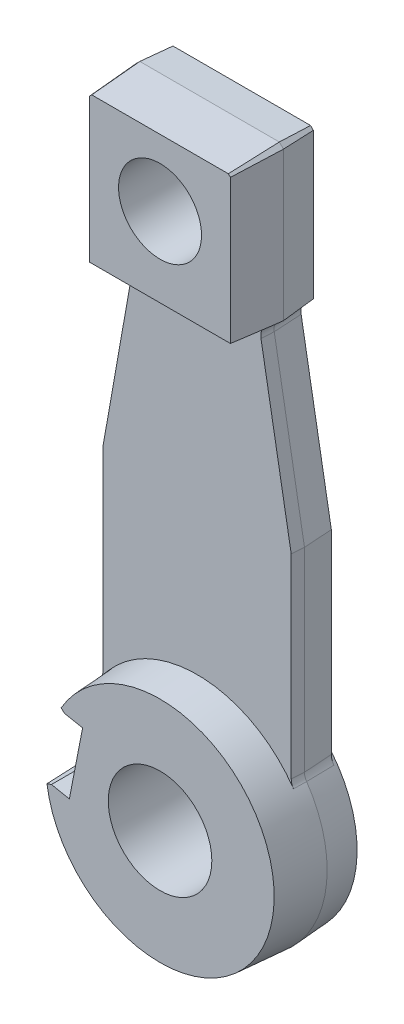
from build123d import *
from build123d.topology import SkipClean

# Parameters (mm, degrees)
BASE_EXTRUSION_DEPTH         = 7
BASE_EXTRUSION_DRAFT         = -4
BOSS_EXTRU_1_DEPTH           = 3
BOSS_EXTRU_1_TAPER           = 4
ESQUISSE3_R                  = 28.290219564
BOSS_EXTRU_2_DEPTH           = 9
BOSS_EXTRU_2_DRAFT           = 4
BOSS_EXTRU_2_PROFILE_2_DEPTH = 9
BOSS_EXTRU_2_PROFILE_2_DRAFT = 4
ESQUISSE7_R                  = 28.010512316
BOSS_EXTRU_3_DEPTH           = 0.8
BOSS_EXTRU_3_DRAFT           = 4
BOSS_EXTRU_3_PROFILE_2_DEPTH = 0.8
BOSS_EXTRU_3_PROFILE_2_DRAFT = 4
ESQUISSE4_R                  = 10.05
ESQUISSE4_R_2                = 12.55
ENL_V_MAT_EXTRU_1_DEPTH      = 25


with BuildPart() as part:
    # Esquisse1 → Base-Extrusion (with draft: the straight prism first)
    with BuildSketch(Plane.XY):
        with BuildLine():
            ThreePointArc((-23, 17.783419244), (-23.133942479, 16.897013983), (-23.523809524, 16.089760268))
            ThreePointArc((-23.523809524, 16.089760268), (0, -28.5), (23.523809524, 16.089760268))
            ThreePointArc((23.523809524, 16.089760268), (23.133942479, 16.897013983), (23, 17.783419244))
            Line((23, 17.783419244), (23, 65))
            Line((23, 65), (15.670449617, 106.567945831))
            ThreePointArc((15.670449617, 106.567945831), (16.109111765, 108.723193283), (17.9, 110))
            Line((17.9, 110), (17.9, 146))
            Line((17.9, 146), (16.9, 147))
            Line((16.9, 147), (-16.9, 147))
            Line((-16.9, 147), (-17.9, 146))
            Line((-17.9, 146), (-17.9, 110))
            ThreePointArc((-17.9, 110), (-16.109111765, 108.723193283), (-15.670449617, 106.567945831))
            Line((-15.670449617, 106.567945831), (-23, 65))
            Line((-23, 65), (-23, 17.783419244))
        make_face()
    extrude(amount=-BASE_EXTRUSION_DEPTH)
    # Base-Extrusion: the draft: its side faces are tilted about the plane it starts from
    base_extrusion_sides = [part.faces().sort_by_distance(p)[0] for p in [
        (-19.335224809, 85.783972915, -3.5),
        (-23, 41.391709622, -3.5),
        (-23.133942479, 16.897013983, -3.5),
        (0, -28.5, -3.5),
        (23.133942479, 16.897013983, -3.5),
        (23, 41.391709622, -3.5),
        (19.335224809, 85.783972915, -3.5),
        (16.109111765, 108.723193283, -3.5),
        (17.9, 128, -3.5),
        (17.4, 146.5, -3.5),
        (0, 147, -3.5),
        (-17.4, 146.5, -3.5),
        (-17.9, 128, -3.5),
        (-16.109111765, 108.723193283, -3.5),
    ]]
    draft(base_extrusion_sides, Plane.XY, BASE_EXTRUSION_DRAFT)

    # Esquisse2 → Boss.-Extru.1 (add)
    with BuildSketch(Plane.XY):
        with BuildLine():
            Line((-23, 65), (-23, 17.783419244))
            ThreePointArc((-23, 17.783419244), (-23.133942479, 16.897013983), (-23.523809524, 16.089760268))
            ThreePointArc((-23.523809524, 16.089760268), (0, -28.5), (23.523809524, 16.089760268))
            ThreePointArc((23.523809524, 16.089760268), (23.133942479, 16.897013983), (23, 17.783419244))
            Line((23, 17.783419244), (23, 65))
            Line((23, 65), (15.670449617, 106.567945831))
            ThreePointArc((15.670449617, 106.567945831), (16.109111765, 108.723193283), (17.9, 110))
            Line((17.9, 110), (17.9, 146))
            Line((17.9, 146), (16.9, 147))
            Line((16.9, 147), (-16.9, 147))
            Line((-16.9, 147), (-17.9, 146))
            Line((-17.9, 146), (-17.9, 110))
            ThreePointArc((-17.9, 110), (-16.109111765, 108.723193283), (-15.670449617, 106.567945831))
            Line((-15.670449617, 106.567945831), (-23, 65))
        make_face()
    extrude(amount=BOSS_EXTRU_1_DEPTH, taper=BOSS_EXTRU_1_TAPER)


with BuildPart() as boss_extru_2_tool:
    # Esquisse3 → Boss.-Extru.2 (with draft: the straight prism first)
    with BuildSketch(Plane.XY.offset(3)):
        Circle(ESQUISSE3_R)
    extrude(amount=BOSS_EXTRU_2_DEPTH)
    # Boss.-Extru.2: the draft: its side faces are tilted about the plane it starts from
    boss_extru_2_sides = [boss_extru_2_tool.faces().sort_by_distance(p)[0] for p in [
        (-28.290219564, 0, 7.5),
    ]]
    draft(boss_extru_2_sides, Plane.XY.offset(3), BOSS_EXTRU_2_DRAFT)


with BuildPart() as part_1:
    add(part.part)

    # Boss.-Extru.2: add boss_extru_2_tool
    add(boss_extru_2_tool.part)


with BuildPart() as boss_extru_2_profile_2_tool:
    # Esquisse3 → Boss.-Extru.2 profile 2 (with draft: the straight prism first)
    with BuildSketch(Plane.XY.offset(3)):
        Polygon((-17.690219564, 110.159576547), (17.690219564, 110.159576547), (17.690219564, 145.913106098), (16.813106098, 146.790219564), (-16.813106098, 146.790219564), (-17.690219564, 145.913106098), align=None)
    extrude(amount=BOSS_EXTRU_2_PROFILE_2_DEPTH)
    # Boss.-Extru.2 profile 2: the draft: its side faces are tilted about the plane it starts from
    boss_extru_2_profile_2_sides = [boss_extru_2_profile_2_tool.faces().sort_by_distance(p)[0] for p in [
        (0, 110.159576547, 7.5),
        (17.690219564, 128.036341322, 7.5),
        (17.251662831, 146.351662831, 7.5),
        (0, 146.790219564, 7.5),
        (-17.251662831, 146.351662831, 7.5),
        (-17.690219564, 128.036341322, 7.5),
    ]]
    draft(boss_extru_2_profile_2_sides, Plane.XY.offset(3), BOSS_EXTRU_2_PROFILE_2_DRAFT)


with BuildPart() as part_2:
    add(part_1.part)

    # Boss.-Extru.2 profile 2: add boss_extru_2_profile_2_tool
    add(boss_extru_2_profile_2_tool.part)


with BuildPart() as boss_extru_3_tool:
    # Esquisse7 → Boss.-Extru.3 (with draft: the straight prism first)
    with BuildSketch(Plane(origin=(0, 0, -7), x_dir=(-1, 0, 0), z_dir=(0, 0, -1))):
        Circle(ESQUISSE7_R)
    extrude(amount=BOSS_EXTRU_3_DEPTH)
    # Boss.-Extru.3: the draft: its side faces are tilted about the plane it starts from
    boss_extru_3_sides = [boss_extru_3_tool.faces().sort_by_distance(p)[0] for p in [
        (28.010512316, 0, -7.4),
    ]]
    draft(boss_extru_3_sides, Plane(origin=(0, 0, -7), x_dir=(-1, 0, 0), z_dir=(0, 0, -1)), BOSS_EXTRU_3_DRAFT)


with BuildPart() as part_3:
    add(part_2.part)

    # Boss.-Extru.3: add boss_extru_3_tool
    add(boss_extru_3_tool.part)


with BuildPart() as boss_extru_3_profile_2_tool:
    # Esquisse7 → Boss.-Extru.3 profile 2 (with draft: the straight prism first)
    with BuildSketch(Plane(origin=(0, 0, -7), x_dir=(-1, 0, 0), z_dir=(0, 0, -1))):
        Polygon((17.410512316, 145.797247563), (16.697247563, 146.510512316), (-16.697247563, 146.510512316), (-17.410512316, 145.797247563), (-17.410512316, 110.360258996), (17.410512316, 110.360258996), align=None)
    extrude(amount=BOSS_EXTRU_3_PROFILE_2_DEPTH)
    # Boss.-Extru.3 profile 2: the draft: its side faces are tilted about the plane it starts from
    boss_extru_3_profile_2_sides = [boss_extru_3_profile_2_tool.faces().sort_by_distance(p)[0] for p in [
        (-17.05387994, 146.15387994, -7.4),
        (0, 146.510512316, -7.4),
        (17.05387994, 146.15387994, -7.4),
        (17.410512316, 128.078753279, -7.4),
        (0, 110.360258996, -7.4),
        (-17.410512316, 128.078753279, -7.4),
    ]]
    draft(boss_extru_3_profile_2_sides, Plane(origin=(0, 0, -7), x_dir=(-1, 0, 0), z_dir=(0, 0, -1)), BOSS_EXTRU_3_PROFILE_2_DRAFT)


with BuildPart() as part_4:
    add(part_3.part)

    # Boss.-Extru.3 profile 2: add boss_extru_3_profile_2_tool
    add(boss_extru_3_profile_2_tool.part)

    # Esquisse4 → Enl_v. mat.-Extru.1 (cut, symmetric)
    with SkipClean():  # the faces are left unmerged after this step: merging them gives an invalid solid
        with BuildSketch(Plane.XY):
            with Locations((0, 130)):
                Circle(ESQUISSE4_R)
            Circle(ESQUISSE4_R_2)
            with BuildLine():
                Line((-18.765968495, 12.204954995), (-21.971559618, -4.286381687))
                Line((-21.971559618, -4.286381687), (-26.313446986, -3.442404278))
                Line((-26.313446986, -3.442404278), (-28.204484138, -4.093540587))
                ThreePointArc((-28.204484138, -4.093540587), (-27.976374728, 5.438056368), (-24.617275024, 14.361050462))
                Line((-24.617275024, 14.361050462), (-23.107855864, 13.048932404))
                Line((-23.107855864, 13.048932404), (-18.765968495, 12.204954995))
            make_face()
        extrude(amount=ENL_V_MAT_EXTRU_1_DEPTH, both=True, mode=Mode.SUBTRACT)


solid = part_4.part
